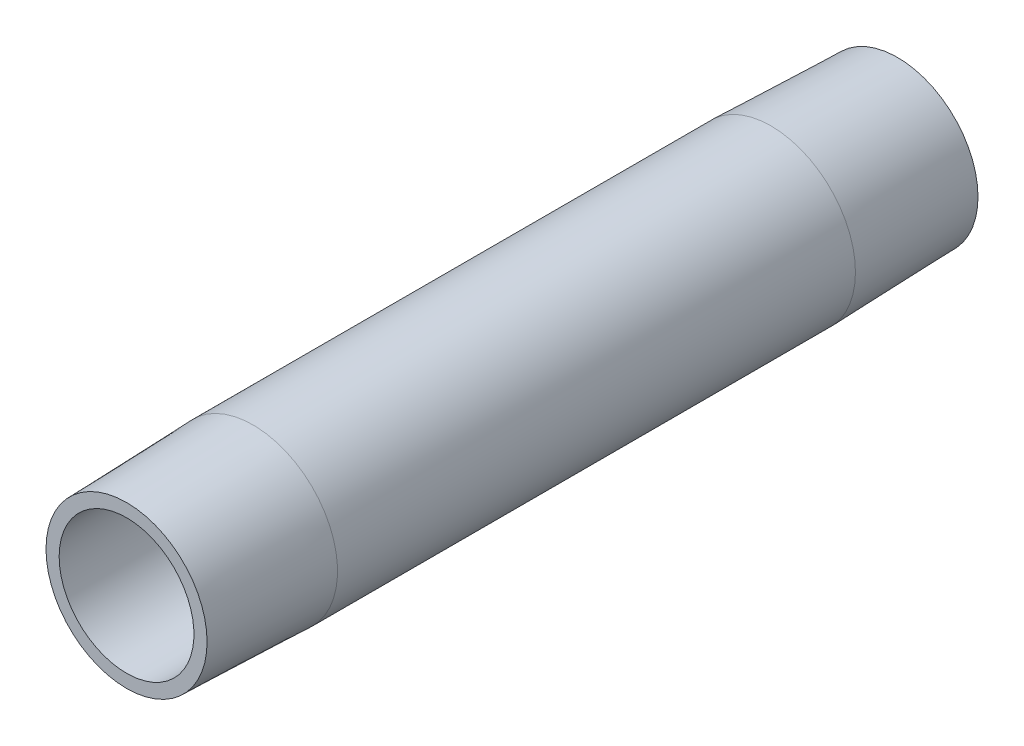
from build123d import *

# Parameters (mm, degrees)
PIPESKETCH_R    = 16.7005
PIPESKETCH_R_2  = 13.3223
EXTRUSION_DEPTH = 152.4


with BuildPart() as part:
    # PipeSketch → Extrusion (new body)
    with BuildSketch(Plane.XY):
        with Locations(Location((0, 0, 0), (0, 0, 180))):
            Circle(PIPESKETCH_R)
        with Locations(Location((0, 0, 0), (0, 0, 180))):
            Circle(PIPESKETCH_R_2, mode=Mode.SUBTRACT)
    extrude(amount=EXTRUSION_DEPTH)

    # ThdSketch → Thread (revolve, cut)
    with BuildSketch(Plane(origin=(0, 0, 0), x_dir=(0, 0, -1), z_dir=(1, 0, 0)), mode=Mode.PRIVATE) as thread_sk:
        Polygon((-127.3937, 16.7005), (-152.4, 15.921926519), (-152.4, 16.7005), align=None)
        Polygon((0, 16.7005), (-25.0063, 16.7005), (0, 15.921926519), align=None)
    revolve(thread_sk.sketch.rotate(Axis((0, 0, 152.4), (0, 0, -1)), 270), axis=Axis((0, 0, 152.4), (0, 0, -1)), mode=Mode.SUBTRACT)


solid = part.part
